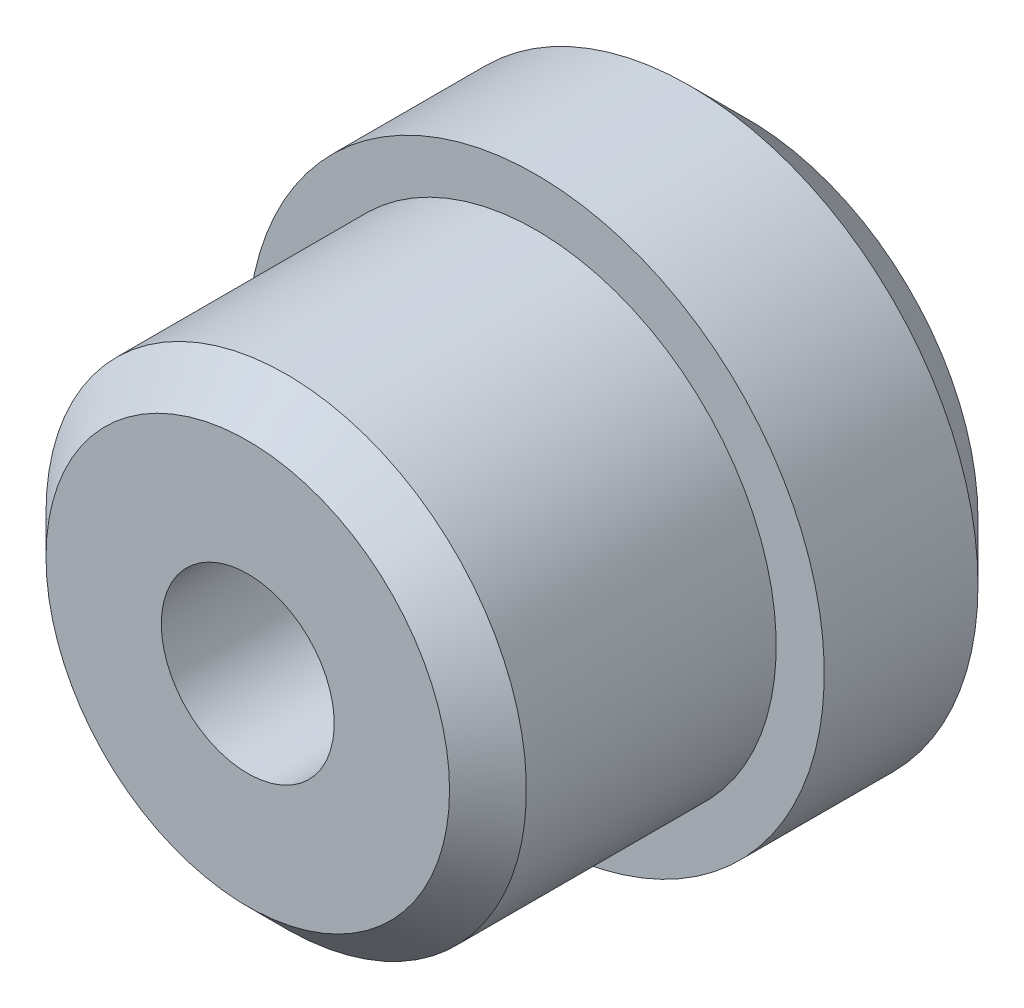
from build123d import *

# Parameters (mm, degrees)
ESQUISSE1_R                                     = 12.5
EXTRUSION1_DEPTH                                = 26
CHANFREIN1_SIZE                                 = 2
CHAMBRAGE_POUR_VIS_T_TE_CYLINDRIQUE_D           = 9
CHAMBRAGE_POUR_VIS_T_TE_CYLINDRIQUE_CBORE_D     = 15
CHAMBRAGE_POUR_VIS_T_TE_CYLINDRIQUE_CBORE_DEPTH = 13
ESQUISSE5_R                                     = 15
ESQUISSE5_R_2                                   = 12.5
EXTRUSION2_DEPTH                                = 11
CHANFREIN2_SIZE                                 = 3


with BuildPart() as part:
    # Esquisse1 → Extrusion1 (new body)
    with BuildSketch(Plane.XY):
        with Locations(Location((0, 0, 0), (0, 0, 180))):
            Circle(ESQUISSE1_R)
    extrude(amount=EXTRUSION1_DEPTH)

    # Chanfrein1
    chanfrein1_edges = [part.edges().sort_by_distance(p)[0] for p in [
        (12.5, 0, 26),
    ]]
    chamfer(chanfrein1_edges, length=CHANFREIN1_SIZE)

    # Chambrage pour vis _ t_te cylindrique (through all)
    with Locations(Plane(origin=(0, 0, 0), x_dir=(-1, 0, 0), z_dir=(0, 0, -1))):
        with Locations((0, 0)):
            CounterBoreHole(CHAMBRAGE_POUR_VIS_T_TE_CYLINDRIQUE_D / 2, CHAMBRAGE_POUR_VIS_T_TE_CYLINDRIQUE_CBORE_D / 2, CHAMBRAGE_POUR_VIS_T_TE_CYLINDRIQUE_CBORE_DEPTH)

    # Esquisse5 → Extrusion2 (add)
    with BuildSketch(Plane(origin=(0, 0, 0), x_dir=(-1, 0, 0), z_dir=(0, 0, -1))):
        Circle(ESQUISSE5_R)
        Circle(ESQUISSE5_R_2, mode=Mode.SUBTRACT)
    extrude(amount=-EXTRUSION2_DEPTH)

    # Chanfrein2
    chanfrein2_edges = [part.edges().sort_by_distance(p)[0] for p in [
        (15, 0, 0),
    ]]
    chamfer(chanfrein2_edges, length=CHANFREIN2_SIZE)


solid = part.part
